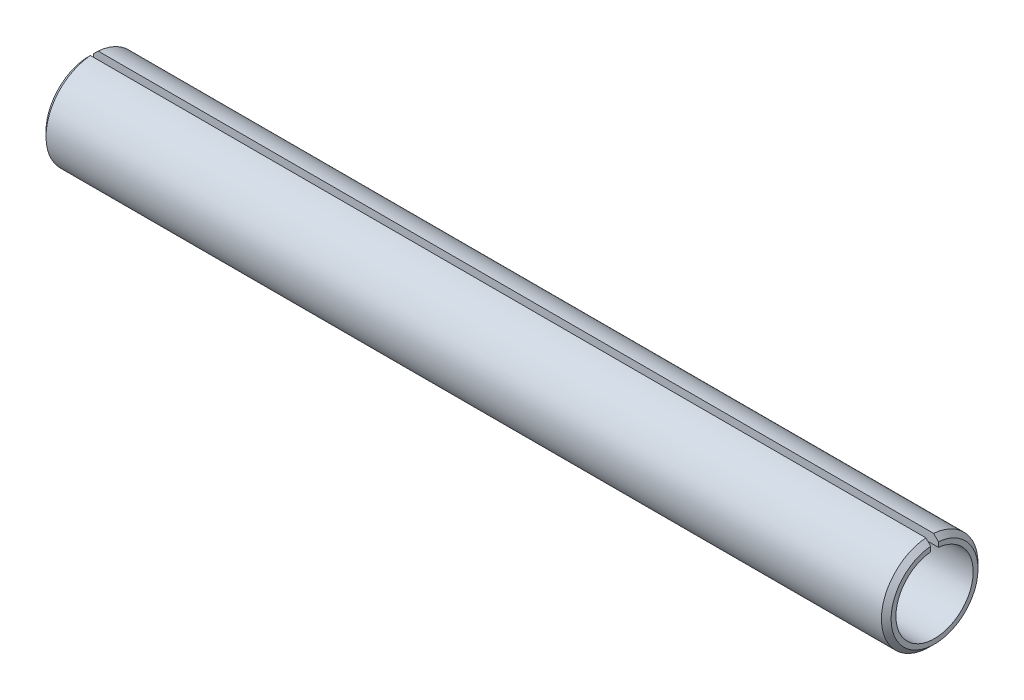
ISO-10303-21;
HEADER;
FILE_DESCRIPTION(('STEP AP214'),'2;1');
FILE_NAME('part.step','',(''),(''),'','','');
FILE_SCHEMA(('AUTOMOTIVE_DESIGN { 1 0 10303 214 1 1 1 1 }'));
ENDSEC;
DATA;
#1=APPLICATION_CONTEXT('core data for automotive mechanical design processes');
#2=APPLICATION_PROTOCOL_DEFINITION('international standard','automotive_design',2000,#1);
#3=PRODUCT_CONTEXT('',#1,'mechanical');
#4=PRODUCT('Part','Part','',(#3));
#5=PRODUCT_RELATED_PRODUCT_CATEGORY('part','',(#4));
#6=PRODUCT_DEFINITION_FORMATION('','',#4);
#7=PRODUCT_DEFINITION_CONTEXT('part definition',#1,'design');
#8=PRODUCT_DEFINITION('design','',#6,#7);
#9=PRODUCT_DEFINITION_SHAPE('','',#8);
#10=(LENGTH_UNIT() NAMED_UNIT(*) SI_UNIT(.MILLI.,.METRE.));
#11=(NAMED_UNIT(*) PLANE_ANGLE_UNIT() SI_UNIT($,.RADIAN.));
#12=(NAMED_UNIT(*) SI_UNIT($,.STERADIAN.) SOLID_ANGLE_UNIT());
#13=UNCERTAINTY_MEASURE_WITH_UNIT(LENGTH_MEASURE(1.E-05),#10,'distance_accuracy_value','');
#14=(GEOMETRIC_REPRESENTATION_CONTEXT(3) GLOBAL_UNCERTAINTY_ASSIGNED_CONTEXT((#13)) GLOBAL_UNIT_ASSIGNED_CONTEXT((#10,
#11,#12)) REPRESENTATION_CONTEXT('',''));
#15=CARTESIAN_POINT('',(0.,0.,0.));
#16=DIRECTION('',(0.,0.,1.));
#17=DIRECTION('',(1.,0.,0.));
#18=AXIS2_PLACEMENT_3D('',#15,#16,#17);
#19=CARTESIAN_POINT('',(0.,0.,1.66533453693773E-13));
#20=DIRECTION('',(-1.,0.,0.));
#21=DIRECTION('',(0.,0.,1.));
#22=AXIS2_PLACEMENT_3D('',#19,#20,#21);
#23=CYLINDRICAL_SURFACE('',#22,1.6);
#24=DIRECTION('',(-1.,0.,0.));
#25=VECTOR('',#24,1.);
#26=CARTESIAN_POINT('',(35.,1.59197989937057,0.16000000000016));
#27=LINE('',#26,#25);
#28=CARTESIAN_POINT('',(35.,1.59197989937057,0.16000000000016));
#29=VERTEX_POINT('',#28);
#30=CARTESIAN_POINT('',(0.,1.59197989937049,0.16000000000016));
#31=VERTEX_POINT('',#30);
#32=EDGE_CURVE('E44',#29,#31,#27,.T.);
#33=ORIENTED_EDGE('',*,*,#32,.F.);
#34=CARTESIAN_POINT('',(35.,0.,1.66533453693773E-13));
#35=DIRECTION('',(-1.,0.,0.));
#36=DIRECTION('',(0.,0.,1.));
#37=AXIS2_PLACEMENT_3D('',#34,#35,#36);
#38=CIRCLE('',#37,1.6);
#39=CARTESIAN_POINT('',(35.,1.59197989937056,-0.159999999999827));
#40=VERTEX_POINT('',#39);
#41=EDGE_CURVE('E86',#40,#29,#38,.T.);
#42=ORIENTED_EDGE('',*,*,#41,.F.);
#43=DIRECTION('',(-1.,0.,0.));
#44=VECTOR('',#43,1.);
#45=CARTESIAN_POINT('',(35.,1.59197989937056,-0.159999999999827));
#46=LINE('',#45,#44);
#47=CARTESIAN_POINT('',(0.,1.59197989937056,-0.159999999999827));
#48=VERTEX_POINT('',#47);
#49=EDGE_CURVE('E80',#40,#48,#46,.T.);
#50=ORIENTED_EDGE('',*,*,#49,.T.);
#51=CARTESIAN_POINT('',(0.,0.,1.66533453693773E-13));
#52=DIRECTION('',(-1.,0.,0.));
#53=DIRECTION('',(0.,0.,1.));
#54=AXIS2_PLACEMENT_3D('',#51,#52,#53);
#55=CIRCLE('',#54,1.6);
#56=EDGE_CURVE('E90',#48,#31,#55,.T.);
#57=ORIENTED_EDGE('',*,*,#56,.T.);
#58=EDGE_LOOP('',(#33,#42,#50,#57));
#59=FACE_BOUND('',#58,.T.);
#60=ADVANCED_FACE('F30',(#59),#23,.F.);
#61=CARTESIAN_POINT('',(35.,1.59999999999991,1.66533453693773E-13));
#62=DIRECTION('',(-1.,0.,0.));
#63=DIRECTION('',(0.,0.,1.));
#64=AXIS2_PLACEMENT_3D('',#61,#62,#63);
#65=PLANE('',#64);
#66=DIRECTION('',(0.,-1.,0.));
#67=VECTOR('',#66,1.);
#68=CARTESIAN_POINT('',(35.,1.99358972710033,0.16000000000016));
#69=LINE('',#68,#67);
#70=CARTESIAN_POINT('',(35.,1.79287478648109,0.16000000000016));
#71=VERTEX_POINT('',#70);
#72=EDGE_CURVE('E121',#71,#29,#69,.T.);
#73=ORIENTED_EDGE('',*,*,#72,.F.);
#74=CARTESIAN_POINT('',(35.,0.,1.66533453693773E-13));
#75=DIRECTION('',(-1.,0.,0.));
#76=DIRECTION('',(0.,0.,1.));
#77=AXIS2_PLACEMENT_3D('',#74,#75,#76);
#78=CIRCLE('',#77,1.8);
#79=CARTESIAN_POINT('',(35.,1.79287478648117,-0.159999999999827));
#80=VERTEX_POINT('',#79);
#81=EDGE_CURVE('E114',#80,#71,#78,.T.);
#82=ORIENTED_EDGE('',*,*,#81,.F.);
#83=DIRECTION('',(0.,-1.,0.));
#84=VECTOR('',#83,1.);
#85=CARTESIAN_POINT('',(35.,1.99358972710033,-0.159999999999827));
#86=LINE('',#85,#84);
#87=EDGE_CURVE('E122',#80,#40,#86,.T.);
#88=ORIENTED_EDGE('',*,*,#87,.T.);
#89=ORIENTED_EDGE('',*,*,#41,.T.);
#90=EDGE_LOOP('',(#73,#82,#88,#89));
#91=FACE_BOUND('',#90,.T.);
#92=ADVANCED_FACE('F119',(#91),#65,.F.);
#93=CARTESIAN_POINT('',(35.,0.,1.66533453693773E-13));
#94=DIRECTION('',(-1.,0.,0.));
#95=DIRECTION('',(0.,0.,1.));
#96=AXIS2_PLACEMENT_3D('',#93,#94,#95);
#97=CONICAL_SURFACE('',#96,1.8,0.785398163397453);
#98=CARTESIAN_POINT('',(34.3206966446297,2.47413522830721,0.16000000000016));
#99=CARTESIAN_POINT('',(34.4256237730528,2.36898675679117,0.160000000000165));
#100=CARTESIAN_POINT('',(34.5305392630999,2.26382666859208,0.160000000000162));
#101=CARTESIAN_POINT('',(34.7403272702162,2.05346375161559,0.160000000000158));
#102=CARTESIAN_POINT('',(34.8451997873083,1.9482609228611,0.160000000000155));
#103=CARTESIAN_POINT('',(35.0548823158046,1.73779285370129,0.160000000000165));
#104=CARTESIAN_POINT('',(35.1596923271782,1.63252761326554,0.160000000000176));
#105=CARTESIAN_POINT('',(35.3691888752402,1.42187423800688,0.160000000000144));
#106=CARTESIAN_POINT('',(35.473875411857,1.31648610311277,0.1600000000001));
#107=CARTESIAN_POINT('',(35.5784696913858,1.2110063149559,0.159999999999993));
#108=B_SPLINE_CURVE_WITH_KNOTS('',3,(#98,#99,#100,#101,#102,#103,#104,#105,#106,#107),
.UNSPECIFIED.,.F.,.F.,(4,2,2,2,4),(0.,0.445637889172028,0.891275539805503,1.33691340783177,
1.78255153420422),.UNSPECIFIED.);
#109=CARTESIAN_POINT('',(34.8,1.99358972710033,0.16000000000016));
#110=VERTEX_POINT('',#109);
#111=EDGE_CURVE('E96',#110,#71,#108,.T.);
#112=ORIENTED_EDGE('',*,*,#111,.F.);
#113=CARTESIAN_POINT('',(34.8,0.,1.66533453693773E-13));
#114=DIRECTION('',(-1.,0.,0.));
#115=DIRECTION('',(0.,0.,1.));
#116=AXIS2_PLACEMENT_3D('',#113,#114,#115);
#117=CIRCLE('',#116,2.);
#118=CARTESIAN_POINT('',(34.8,1.99358972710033,-0.159999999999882));
#119=VERTEX_POINT('',#118);
#120=EDGE_CURVE('E111',#119,#110,#117,.T.);
#121=ORIENTED_EDGE('',*,*,#120,.F.);
#122=CARTESIAN_POINT('',(34.3206966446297,2.47413522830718,-0.159999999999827));
#123=CARTESIAN_POINT('',(34.4256237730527,2.36898675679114,-0.159999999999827));
#124=CARTESIAN_POINT('',(34.5305392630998,2.26382666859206,-0.159999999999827));
#125=CARTESIAN_POINT('',(34.7403272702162,2.05346375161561,-0.159999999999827));
#126=CARTESIAN_POINT('',(34.8451997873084,1.94826092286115,-0.159999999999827));
#127=CARTESIAN_POINT('',(35.0548823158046,1.73779285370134,-0.159999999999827));
#128=CARTESIAN_POINT('',(35.1596923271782,1.63252761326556,-0.159999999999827));
#129=CARTESIAN_POINT('',(35.3691888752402,1.42187423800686,-0.159999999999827));
#130=CARTESIAN_POINT('',(35.473875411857,1.31648610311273,-0.159999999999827));
#131=CARTESIAN_POINT('',(35.5784696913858,1.21100631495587,-0.159999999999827));
#132=B_SPLINE_CURVE_WITH_KNOTS('',3,(#122,#123,#124,#125,#126,#127,#128,#129,#130,#131),
.UNSPECIFIED.,.F.,.F.,(4,2,2,2,4),(0.,0.445637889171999,0.891275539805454,1.33691340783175,
1.78255153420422),.UNSPECIFIED.);
#133=EDGE_CURVE('E138',#119,#80,#132,.T.);
#134=ORIENTED_EDGE('',*,*,#133,.T.);
#135=ORIENTED_EDGE('',*,*,#81,.T.);
#136=EDGE_LOOP('',(#112,#121,#134,#135));
#137=FACE_BOUND('',#136,.T.);
#138=ADVANCED_FACE('F160',(#137),#97,.T.);
#139=CARTESIAN_POINT('',(0.,0.,1.66533453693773E-13));
#140=DIRECTION('',(-1.,0.,0.));
#141=DIRECTION('',(0.,0.,1.));
#142=AXIS2_PLACEMENT_3D('',#139,#140,#141);
#143=CYLINDRICAL_SURFACE('',#142,2.);
#144=DIRECTION('',(-1.,0.,0.));
#145=VECTOR('',#144,1.);
#146=CARTESIAN_POINT('',(35.,1.99358972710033,0.16000000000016));
#147=LINE('',#146,#145);
#148=CARTESIAN_POINT('',(0.199999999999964,1.9935897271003,0.16000000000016));
#149=VERTEX_POINT('',#148);
#150=EDGE_CURVE('E129',#110,#149,#147,.T.);
#151=ORIENTED_EDGE('',*,*,#150,.T.);
#152=CARTESIAN_POINT('',(0.199999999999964,0.,1.66533453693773E-13));
#153=DIRECTION('',(-1.,0.,0.));
#154=DIRECTION('',(0.,0.,1.));
#155=AXIS2_PLACEMENT_3D('',#152,#153,#154);
#156=CIRCLE('',#155,2.);
#157=CARTESIAN_POINT('',(0.199999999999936,1.99358972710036,-0.159999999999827));
#158=VERTEX_POINT('',#157);
#159=EDGE_CURVE('E98',#158,#149,#156,.T.);
#160=ORIENTED_EDGE('',*,*,#159,.F.);
#161=DIRECTION('',(-1.,0.,0.));
#162=VECTOR('',#161,1.);
#163=CARTESIAN_POINT('',(35.,1.99358972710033,-0.159999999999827));
#164=LINE('',#163,#162);
#165=EDGE_CURVE('E92',#119,#158,#164,.T.);
#166=ORIENTED_EDGE('',*,*,#165,.F.);
#167=ORIENTED_EDGE('',*,*,#120,.T.);
#168=EDGE_LOOP('',(#151,#160,#166,#167));
#169=FACE_BOUND('',#168,.T.);
#170=ADVANCED_FACE('F164',(#169),#143,.T.);
#171=CARTESIAN_POINT('',(0.199999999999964,0.,1.66533453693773E-13));
#172=DIRECTION('',(1.,0.,0.));
#173=DIRECTION('',(0.,0.,-1.));
#174=AXIS2_PLACEMENT_3D('',#171,#172,#173);
#175=CONICAL_SURFACE('',#174,2.,0.785398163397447);
#176=CARTESIAN_POINT('',(-0.578469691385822,1.2110063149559,0.159999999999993));
#177=CARTESIAN_POINT('',(-0.473875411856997,1.31648610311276,0.160000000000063));
#178=CARTESIAN_POINT('',(-0.369188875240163,1.42187423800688,0.160000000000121));
#179=CARTESIAN_POINT('',(-0.159692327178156,1.63252761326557,0.1600000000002));
#180=CARTESIAN_POINT('',(-0.0548823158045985,1.73779285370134,0.16000000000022));
#181=CARTESIAN_POINT('',(0.154800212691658,1.94826092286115,0.160000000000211));
#182=CARTESIAN_POINT('',(0.25967272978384,2.05346375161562,0.160000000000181));
#183=CARTESIAN_POINT('',(0.469460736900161,2.26382666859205,0.16000000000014));
#184=CARTESIAN_POINT('',(0.574376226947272,2.36898675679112,0.160000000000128));
#185=CARTESIAN_POINT('',(0.67930335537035,2.47413522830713,0.16000000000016));
#186=B_SPLINE_CURVE_WITH_KNOTS('',3,(#176,#177,#178,#179,#180,#181,#182,#183,#184,#185),
.UNSPECIFIED.,.F.,.F.,(4,2,2,2,4),(0.,0.445638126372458,0.891275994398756,1.3369136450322,
1.78255153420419),.UNSPECIFIED.);
#187=CARTESIAN_POINT('',(0.,1.79287478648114,0.160000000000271));
#188=VERTEX_POINT('',#187);
#189=EDGE_CURVE('E100',#188,#149,#186,.T.);
#190=ORIENTED_EDGE('',*,*,#189,.F.);
#191=CARTESIAN_POINT('',(0.,0.,1.66533453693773E-13));
#192=DIRECTION('',(-1.,0.,0.));
#193=DIRECTION('',(0.,0.,1.));
#194=AXIS2_PLACEMENT_3D('',#191,#192,#193);
#195=CIRCLE('',#194,1.8);
#196=CARTESIAN_POINT('',(0.,1.79287478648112,-0.159999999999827));
#197=VERTEX_POINT('',#196);
#198=EDGE_CURVE('E95',#197,#188,#195,.T.);
#199=ORIENTED_EDGE('',*,*,#198,.F.);
#200=CARTESIAN_POINT('',(-0.578469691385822,1.21100631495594,-0.159999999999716));
#201=CARTESIAN_POINT('',(-0.473875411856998,1.31648610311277,-0.159999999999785));
#202=CARTESIAN_POINT('',(-0.369188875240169,1.42187423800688,-0.159999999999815));
#203=CARTESIAN_POINT('',(-0.159692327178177,1.63252761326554,-0.159999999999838));
#204=CARTESIAN_POINT('',(-0.0548823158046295,1.73779285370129,-0.159999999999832));
#205=CARTESIAN_POINT('',(0.154800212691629,1.94826092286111,-0.159999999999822));
#206=CARTESIAN_POINT('',(0.259672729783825,2.05346375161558,-0.15999999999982));
#207=CARTESIAN_POINT('',(0.469460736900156,2.26382666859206,-0.159999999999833));
#208=CARTESIAN_POINT('',(0.574376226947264,2.36898675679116,-0.15999999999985));
#209=CARTESIAN_POINT('',(0.679303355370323,2.47413522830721,-0.159999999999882));
#210=B_SPLINE_CURVE_WITH_KNOTS('',3,(#200,#201,#202,#203,#204,#205,#206,#207,#208,#209),
.UNSPECIFIED.,.F.,.F.,(4,2,2,2,4),(0.,0.445638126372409,0.891275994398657,1.33691364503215,
1.78255153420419),.UNSPECIFIED.);
#211=EDGE_CURVE('E51',#197,#158,#210,.T.);
#212=ORIENTED_EDGE('',*,*,#211,.T.);
#213=ORIENTED_EDGE('',*,*,#159,.T.);
#214=EDGE_LOOP('',(#190,#199,#212,#213));
#215=FACE_BOUND('',#214,.T.);
#216=ADVANCED_FACE('F142',(#215),#175,.T.);
#217=CARTESIAN_POINT('',(0.,1.59999999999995,1.66533453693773E-13));
#218=DIRECTION('',(-1.,0.,0.));
#219=DIRECTION('',(0.,0.,1.));
#220=AXIS2_PLACEMENT_3D('',#217,#218,#219);
#221=PLANE('',#220);
#222=ORIENTED_EDGE('',*,*,#198,.T.);
#223=DIRECTION('',(0.,-1.,0.));
#224=VECTOR('',#223,1.);
#225=CARTESIAN_POINT('',(0.,1.59999999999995,0.160000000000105));
#226=LINE('',#225,#224);
#227=EDGE_CURVE('E11',#188,#31,#226,.T.);
#228=ORIENTED_EDGE('',*,*,#227,.T.);
#229=ORIENTED_EDGE('',*,*,#56,.F.);
#230=DIRECTION('',(0.,-1.,0.));
#231=VECTOR('',#230,1.);
#232=CARTESIAN_POINT('',(0.,1.59999999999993,-0.159999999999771));
#233=LINE('',#232,#231);
#234=EDGE_CURVE('E37',#197,#48,#233,.T.);
#235=ORIENTED_EDGE('',*,*,#234,.F.);
#236=EDGE_LOOP('',(#222,#228,#229,#235));
#237=FACE_BOUND('',#236,.T.);
#238=ADVANCED_FACE('F94',(#237),#221,.T.);
#239=CARTESIAN_POINT('',(35.,1.99358972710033,-0.159999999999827));
#240=DIRECTION('',(0.,0.,-1.));
#241=DIRECTION('',(0.,1.,0.));
#242=AXIS2_PLACEMENT_3D('',#239,#240,#241);
#243=PLANE('',#242);
#244=ORIENTED_EDGE('',*,*,#165,.T.);
#245=ORIENTED_EDGE('',*,*,#211,.F.);
#246=ORIENTED_EDGE('',*,*,#234,.T.);
#247=ORIENTED_EDGE('',*,*,#49,.F.);
#248=ORIENTED_EDGE('',*,*,#87,.F.);
#249=ORIENTED_EDGE('',*,*,#133,.F.);
#250=EDGE_LOOP('',(#244,#245,#246,#247,#248,#249));
#251=FACE_BOUND('',#250,.T.);
#252=ADVANCED_FACE('F79',(#251),#243,.F.);
#253=CARTESIAN_POINT('',(35.,1.99358972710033,0.16000000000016));
#254=DIRECTION('',(0.,0.,-1.));
#255=DIRECTION('',(0.,1.,0.));
#256=AXIS2_PLACEMENT_3D('',#253,#254,#255);
#257=PLANE('',#256);
#258=ORIENTED_EDGE('',*,*,#111,.T.);
#259=ORIENTED_EDGE('',*,*,#72,.T.);
#260=ORIENTED_EDGE('',*,*,#32,.T.);
#261=ORIENTED_EDGE('',*,*,#227,.F.);
#262=ORIENTED_EDGE('',*,*,#189,.T.);
#263=ORIENTED_EDGE('',*,*,#150,.F.);
#264=EDGE_LOOP('',(#258,#259,#260,#261,#262,#263));
#265=FACE_BOUND('',#264,.T.);
#266=ADVANCED_FACE('F148',(#265),#257,.T.);
#267=CLOSED_SHELL('',(#60,#92,#138,#170,#216,#238,#252,#266));
#268=MANIFOLD_SOLID_BREP('B2',#267);
#269=ADVANCED_BREP_SHAPE_REPRESENTATION('',(#18,#268),#14);
#270=SHAPE_DEFINITION_REPRESENTATION(#9,#269);
ENDSEC;
END-ISO-10303-21;
